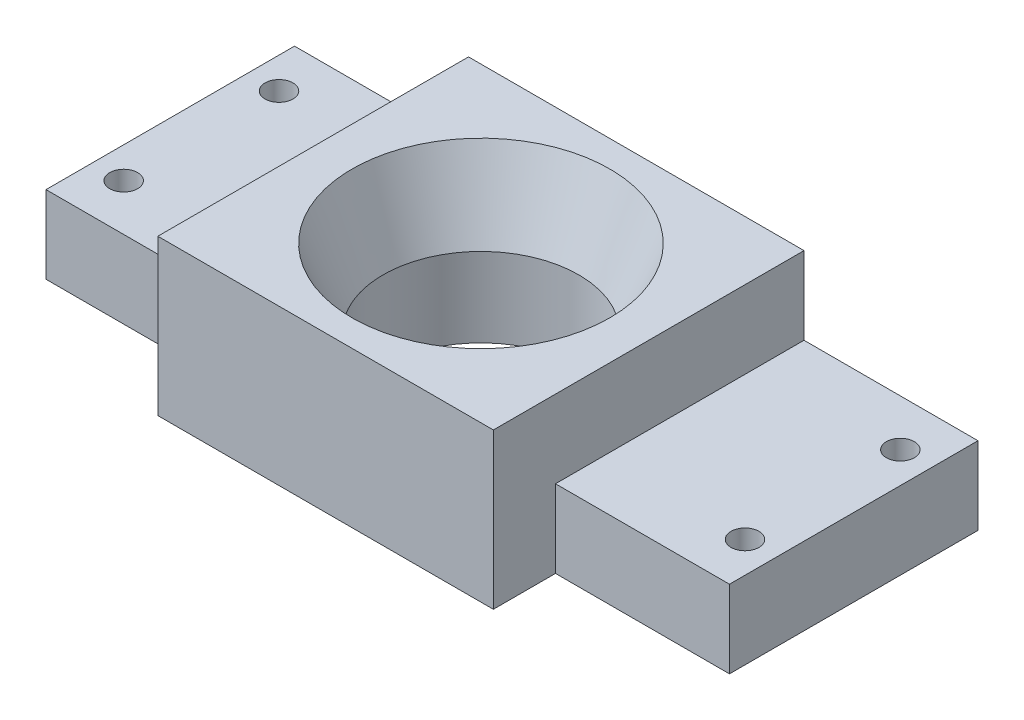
from build123d import *

# Parameters (mm, degrees)
ESQUISSE1_W        = 216
ESQUISSE1_H        = 200
BOSS_EXTRU_1_DEPTH = 100
ESQUISSE4_W        = 112
ESQUISSE4_H        = 160
ESQUISSE4_R        = 9
BOSS_EXTRU_2_DEPTH = 50


with BuildPart() as part:
    # Esquisse1 → Boss.-Extru.1 (new body)
    with BuildSketch(Plane(origin=(0, 0, 0), x_dir=(1, 0, 0), z_dir=(0, 1, 0))):
        Rectangle(ESQUISSE1_W, ESQUISSE1_H)
    extrude(amount=BOSS_EXTRU_1_DEPTH)

    # Esquisse2 → Enl_vement de mati_re-R_volution1 (revolve, cut)
    with BuildSketch(Plane.XY, mode=Mode.PRIVATE) as enl_vement_de_mati_re_r_volution1_sk:
        Polygon((0, 0), (0, 100), (-83, 100), (-63, 51), (-63, 0), align=None)
    revolve(enl_vement_de_mati_re_r_volution1_sk.sketch.rotate(Axis((0, 0, 0), (0, 1, 0)), 180), axis=Axis((0, 0, 0), (0, 1, 0)), mode=Mode.SUBTRACT)

    # Esquisse4 → Boss.-Extru.2 (add)
    with BuildSketch(Plane(origin=(0, 0, 0), x_dir=(1, 0, 0), z_dir=(0, 1, 0))):
        with Locations((-164, 20)):
            Rectangle(ESQUISSE4_W, ESQUISSE4_H)
        with Locations(Location((-200, 70, 0), (0, 0, 270))):
            Circle(ESQUISSE4_R, mode=Mode.SUBTRACT)
        with Locations(Location((-200, -30, 0), (0, 0, 270))):
            Circle(ESQUISSE4_R, mode=Mode.SUBTRACT)
    boss_extru_2 = extrude(amount=BOSS_EXTRU_2_DEPTH)

    # Sym_trie1: Boss.-Extru.2 across plane
    add(boss_extru_2.mirror(Plane(origin=(0, 0, 0), x_dir=(0, 0, 1), z_dir=(1, 0, 0))))


solid = part.part
